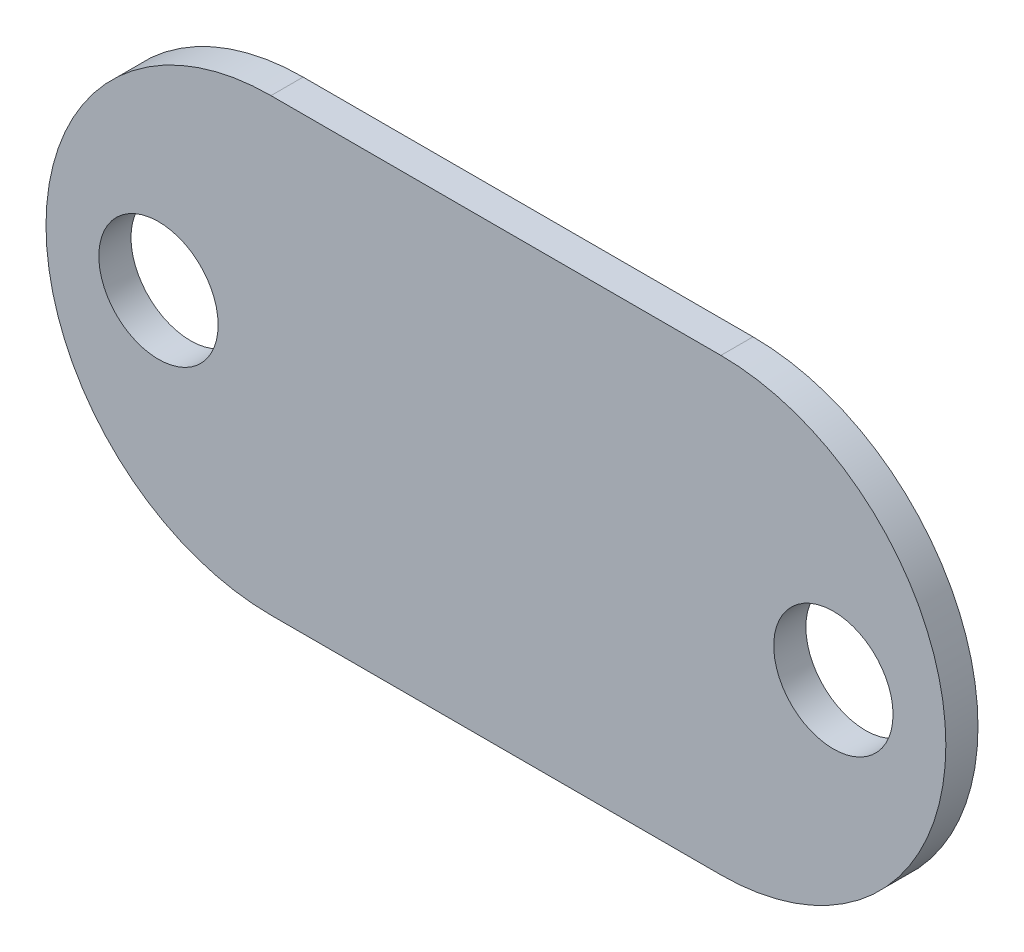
ISO-10303-21;
HEADER;
FILE_DESCRIPTION(('STEP AP214'),'2;1');
FILE_NAME('part.step','',(''),(''),'','','');
FILE_SCHEMA(('AUTOMOTIVE_DESIGN { 1 0 10303 214 1 1 1 1 }'));
ENDSEC;
DATA;
#1=APPLICATION_CONTEXT('core data for automotive mechanical design processes');
#2=APPLICATION_PROTOCOL_DEFINITION('international standard','automotive_design',2000,#1);
#3=PRODUCT_CONTEXT('',#1,'mechanical');
#4=PRODUCT('Part','Part','',(#3));
#5=PRODUCT_RELATED_PRODUCT_CATEGORY('part','',(#4));
#6=PRODUCT_DEFINITION_FORMATION('','',#4);
#7=PRODUCT_DEFINITION_CONTEXT('part definition',#1,'design');
#8=PRODUCT_DEFINITION('design','',#6,#7);
#9=PRODUCT_DEFINITION_SHAPE('','',#8);
#10=(LENGTH_UNIT() NAMED_UNIT(*) SI_UNIT(.MILLI.,.METRE.));
#11=(NAMED_UNIT(*) PLANE_ANGLE_UNIT() SI_UNIT($,.RADIAN.));
#12=(NAMED_UNIT(*) SI_UNIT($,.STERADIAN.) SOLID_ANGLE_UNIT());
#13=UNCERTAINTY_MEASURE_WITH_UNIT(LENGTH_MEASURE(1.E-05),#10,'distance_accuracy_value','');
#14=(GEOMETRIC_REPRESENTATION_CONTEXT(3) GLOBAL_UNCERTAINTY_ASSIGNED_CONTEXT((#13)) GLOBAL_UNIT_ASSIGNED_CONTEXT((#10,
#11,#12)) REPRESENTATION_CONTEXT('',''));
#15=CARTESIAN_POINT('',(0.,0.,0.));
#16=DIRECTION('',(0.,0.,1.));
#17=DIRECTION('',(1.,0.,0.));
#18=AXIS2_PLACEMENT_3D('',#15,#16,#17);
#19=CARTESIAN_POINT('',(-5.55625,0.,0.79375));
#20=DIRECTION('',(0.,0.,-1.));
#21=DIRECTION('',(-1.,0.,0.));
#22=AXIS2_PLACEMENT_3D('',#19,#20,#21);
#23=CYLINDRICAL_SURFACE('',#22,5.55625);
#24=CARTESIAN_POINT('',(-5.55625,0.,0.));
#25=DIRECTION('',(0.,0.,1.));
#26=DIRECTION('',(-1.,0.,0.));
#27=AXIS2_PLACEMENT_3D('',#24,#25,#26);
#28=CIRCLE('',#27,5.55625);
#29=CARTESIAN_POINT('',(-5.55625,5.55625,0.));
#30=VERTEX_POINT('',#29);
#31=CARTESIAN_POINT('',(-5.55625,-5.55625,0.));
#32=VERTEX_POINT('',#31);
#33=EDGE_CURVE('E79',#30,#32,#28,.T.);
#34=ORIENTED_EDGE('',*,*,#33,.T.);
#35=DIRECTION('',(0.,0.,-1.));
#36=VECTOR('',#35,1.);
#37=CARTESIAN_POINT('',(-5.55625,-5.55625,0.79375));
#38=LINE('',#37,#36);
#39=CARTESIAN_POINT('',(-5.55625,-5.55625,0.79375));
#40=VERTEX_POINT('',#39);
#41=EDGE_CURVE('E11',#40,#32,#38,.T.);
#42=ORIENTED_EDGE('',*,*,#41,.F.);
#43=CARTESIAN_POINT('',(-5.55625,0.,0.79375));
#44=DIRECTION('',(0.,0.,1.));
#45=DIRECTION('',(-1.,0.,0.));
#46=AXIS2_PLACEMENT_3D('',#43,#44,#45);
#47=CIRCLE('',#46,5.55625);
#48=CARTESIAN_POINT('',(-5.55625,5.55625,0.79375));
#49=VERTEX_POINT('',#48);
#50=EDGE_CURVE('E102',#49,#40,#47,.T.);
#51=ORIENTED_EDGE('',*,*,#50,.F.);
#52=DIRECTION('',(0.,0.,-1.));
#53=VECTOR('',#52,1.);
#54=CARTESIAN_POINT('',(-5.55625,5.55625,0.79375));
#55=LINE('',#54,#53);
#56=EDGE_CURVE('E91',#49,#30,#55,.T.);
#57=ORIENTED_EDGE('',*,*,#56,.T.);
#58=EDGE_LOOP('',(#34,#42,#51,#57));
#59=FACE_BOUND('',#58,.T.);
#60=ADVANCED_FACE('F33',(#59),#23,.T.);
#61=CARTESIAN_POINT('',(-5.55625,-5.55625,0.79375));
#62=DIRECTION('',(0.,1.,0.));
#63=DIRECTION('',(0.,0.,1.));
#64=AXIS2_PLACEMENT_3D('',#61,#62,#63);
#65=PLANE('',#64);
#66=DIRECTION('',(1.,0.,0.));
#67=VECTOR('',#66,1.);
#68=CARTESIAN_POINT('',(-5.55625,-5.55625,0.));
#69=LINE('',#68,#67);
#70=CARTESIAN_POINT('',(5.55625,-5.55625,0.));
#71=VERTEX_POINT('',#70);
#72=EDGE_CURVE('E75',#32,#71,#69,.T.);
#73=ORIENTED_EDGE('',*,*,#72,.T.);
#74=DIRECTION('',(0.,0.,-1.));
#75=VECTOR('',#74,1.);
#76=CARTESIAN_POINT('',(5.55625,-5.55625,0.79375));
#77=LINE('',#76,#75);
#78=CARTESIAN_POINT('',(5.55625,-5.55625,0.79375));
#79=VERTEX_POINT('',#78);
#80=EDGE_CURVE('E41',#79,#71,#77,.T.);
#81=ORIENTED_EDGE('',*,*,#80,.F.);
#82=DIRECTION('',(1.,0.,0.));
#83=VECTOR('',#82,1.);
#84=CARTESIAN_POINT('',(-5.55625,-5.55625,0.79375));
#85=LINE('',#84,#83);
#86=EDGE_CURVE('E87',#40,#79,#85,.T.);
#87=ORIENTED_EDGE('',*,*,#86,.F.);
#88=ORIENTED_EDGE('',*,*,#41,.T.);
#89=EDGE_LOOP('',(#73,#81,#87,#88));
#90=FACE_BOUND('',#89,.T.);
#91=ADVANCED_FACE('F86',(#90),#65,.F.);
#92=CARTESIAN_POINT('',(5.55625,0.,0.79375));
#93=DIRECTION('',(0.,0.,-1.));
#94=DIRECTION('',(-1.,0.,0.));
#95=AXIS2_PLACEMENT_3D('',#92,#93,#94);
#96=CYLINDRICAL_SURFACE('',#95,5.55625);
#97=CARTESIAN_POINT('',(5.55625,0.,0.));
#98=DIRECTION('',(0.,0.,1.));
#99=DIRECTION('',(1.,0.,0.));
#100=AXIS2_PLACEMENT_3D('',#97,#98,#99);
#101=CIRCLE('',#100,5.55625);
#102=CARTESIAN_POINT('',(5.55625,5.55625,0.));
#103=VERTEX_POINT('',#102);
#104=EDGE_CURVE('E80',#71,#103,#101,.T.);
#105=ORIENTED_EDGE('',*,*,#104,.T.);
#106=DIRECTION('',(0.,0.,-1.));
#107=VECTOR('',#106,1.);
#108=CARTESIAN_POINT('',(5.55625,5.55625,0.79375));
#109=LINE('',#108,#107);
#110=CARTESIAN_POINT('',(5.55625,5.55625,0.79375));
#111=VERTEX_POINT('',#110);
#112=EDGE_CURVE('E108',#111,#103,#109,.T.);
#113=ORIENTED_EDGE('',*,*,#112,.F.);
#114=CARTESIAN_POINT('',(5.55625,0.,0.79375));
#115=DIRECTION('',(0.,0.,1.));
#116=DIRECTION('',(1.,0.,0.));
#117=AXIS2_PLACEMENT_3D('',#114,#115,#116);
#118=CIRCLE('',#117,5.55625);
#119=EDGE_CURVE('E54',#79,#111,#118,.T.);
#120=ORIENTED_EDGE('',*,*,#119,.F.);
#121=ORIENTED_EDGE('',*,*,#80,.T.);
#122=EDGE_LOOP('',(#105,#113,#120,#121));
#123=FACE_BOUND('',#122,.T.);
#124=ADVANCED_FACE('F112',(#123),#96,.T.);
#125=CARTESIAN_POINT('',(-5.55625,5.55625,0.79375));
#126=DIRECTION('',(0.,-1.,0.));
#127=DIRECTION('',(0.,0.,-1.));
#128=AXIS2_PLACEMENT_3D('',#125,#126,#127);
#129=PLANE('',#128);
#130=DIRECTION('',(-1.,0.,0.));
#131=VECTOR('',#130,1.);
#132=CARTESIAN_POINT('',(-5.55625,5.55625,0.));
#133=LINE('',#132,#131);
#134=EDGE_CURVE('E100',#103,#30,#133,.T.);
#135=ORIENTED_EDGE('',*,*,#134,.T.);
#136=ORIENTED_EDGE('',*,*,#56,.F.);
#137=DIRECTION('',(-1.,0.,0.));
#138=VECTOR('',#137,1.);
#139=CARTESIAN_POINT('',(-5.55625,5.55625,0.79375));
#140=LINE('',#139,#138);
#141=EDGE_CURVE('E49',#111,#49,#140,.T.);
#142=ORIENTED_EDGE('',*,*,#141,.F.);
#143=ORIENTED_EDGE('',*,*,#112,.T.);
#144=EDGE_LOOP('',(#135,#136,#142,#143));
#145=FACE_BOUND('',#144,.T.);
#146=ADVANCED_FACE('F114',(#145),#129,.F.);
#147=CARTESIAN_POINT('',(-5.55625,0.,0.79375));
#148=DIRECTION('',(0.,0.,-1.));
#149=DIRECTION('',(-1.,0.,0.));
#150=AXIS2_PLACEMENT_3D('',#147,#148,#149);
#151=PLANE('',#150);
#152=CARTESIAN_POINT('',(-8.334375,0.,0.793750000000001));
#153=DIRECTION('',(0.,0.,1.));
#154=DIRECTION('',(1.,0.,0.));
#155=AXIS2_PLACEMENT_3D('',#152,#153,#154);
#156=CIRCLE('',#155,1.4732);
#157=CARTESIAN_POINT('',(-6.861175,0.,0.793750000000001));
#158=VERTEX_POINT('',#157);
#159=EDGE_CURVE('E183',#158,#158,#156,.T.);
#160=ORIENTED_EDGE('',*,*,#159,.F.);
#161=EDGE_LOOP('',(#160));
#162=FACE_BOUND('',#161,.T.);
#163=CARTESIAN_POINT('',(8.334375,0.,0.793750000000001));
#164=DIRECTION('',(0.,0.,1.));
#165=DIRECTION('',(1.,0.,0.));
#166=AXIS2_PLACEMENT_3D('',#163,#164,#165);
#167=CIRCLE('',#166,1.4732);
#168=CARTESIAN_POINT('',(9.807575,0.,0.793750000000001));
#169=VERTEX_POINT('',#168);
#170=EDGE_CURVE('E95',#169,#169,#167,.T.);
#171=ORIENTED_EDGE('',*,*,#170,.F.);
#172=EDGE_LOOP('',(#171));
#173=FACE_BOUND('',#172,.T.);
#174=ORIENTED_EDGE('',*,*,#50,.T.);
#175=ORIENTED_EDGE('',*,*,#86,.T.);
#176=ORIENTED_EDGE('',*,*,#119,.T.);
#177=ORIENTED_EDGE('',*,*,#141,.T.);
#178=EDGE_LOOP('',(#174,#175,#176,#177));
#179=FACE_BOUND('',#178,.T.);
#180=ADVANCED_FACE('F115',(#162,#173,#179),#151,.F.);
#181=CARTESIAN_POINT('',(-5.55625,0.,0.));
#182=DIRECTION('',(0.,0.,-1.));
#183=DIRECTION('',(-1.,0.,0.));
#184=AXIS2_PLACEMENT_3D('',#181,#182,#183);
#185=PLANE('',#184);
#186=CARTESIAN_POINT('',(-8.334375,0.,0.));
#187=DIRECTION('',(0.,0.,-1.));
#188=DIRECTION('',(-1.,0.,0.));
#189=AXIS2_PLACEMENT_3D('',#186,#187,#188);
#190=CIRCLE('',#189,1.4732);
#191=CARTESIAN_POINT('',(-9.80757499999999,0.,0.));
#192=VERTEX_POINT('',#191);
#193=EDGE_CURVE('E36',#192,#192,#190,.T.);
#194=ORIENTED_EDGE('',*,*,#193,.F.);
#195=EDGE_LOOP('',(#194));
#196=FACE_BOUND('',#195,.T.);
#197=CARTESIAN_POINT('',(8.334375,0.,0.));
#198=DIRECTION('',(0.,0.,-1.));
#199=DIRECTION('',(-1.,0.,0.));
#200=AXIS2_PLACEMENT_3D('',#197,#198,#199);
#201=CIRCLE('',#200,1.4732);
#202=CARTESIAN_POINT('',(6.861175,0.,0.));
#203=VERTEX_POINT('',#202);
#204=EDGE_CURVE('E92',#203,#203,#201,.T.);
#205=ORIENTED_EDGE('',*,*,#204,.F.);
#206=EDGE_LOOP('',(#205));
#207=FACE_BOUND('',#206,.T.);
#208=ORIENTED_EDGE('',*,*,#33,.F.);
#209=ORIENTED_EDGE('',*,*,#134,.F.);
#210=ORIENTED_EDGE('',*,*,#104,.F.);
#211=ORIENTED_EDGE('',*,*,#72,.F.);
#212=EDGE_LOOP('',(#208,#209,#210,#211));
#213=FACE_BOUND('',#212,.T.);
#214=ADVANCED_FACE('F76',(#196,#207,#213),#185,.T.);
#215=CARTESIAN_POINT('',(8.334375,0.,0.79375));
#216=DIRECTION('',(0.,0.,1.));
#217=DIRECTION('',(1.,0.,0.));
#218=AXIS2_PLACEMENT_3D('',#215,#216,#217);
#219=CYLINDRICAL_SURFACE('',#218,1.4732);
#220=ORIENTED_EDGE('',*,*,#204,.T.);
#221=EDGE_LOOP('',(#220));
#222=FACE_BOUND('',#221,.T.);
#223=ORIENTED_EDGE('',*,*,#170,.T.);
#224=EDGE_LOOP('',(#223));
#225=FACE_BOUND('',#224,.T.);
#226=ADVANCED_FACE('F123',(#222,#225),#219,.F.);
#227=CARTESIAN_POINT('',(-8.334375,0.,0.79375));
#228=DIRECTION('',(0.,0.,1.));
#229=DIRECTION('',(1.,0.,0.));
#230=AXIS2_PLACEMENT_3D('',#227,#228,#229);
#231=CYLINDRICAL_SURFACE('',#230,1.4732);
#232=ORIENTED_EDGE('',*,*,#193,.T.);
#233=EDGE_LOOP('',(#232));
#234=FACE_BOUND('',#233,.T.);
#235=ORIENTED_EDGE('',*,*,#159,.T.);
#236=EDGE_LOOP('',(#235));
#237=FACE_BOUND('',#236,.T.);
#238=ADVANCED_FACE('F165',(#234,#237),#231,.F.);
#239=CLOSED_SHELL('',(#60,#91,#124,#146,#180,#214,#226,#238));
#240=MANIFOLD_SOLID_BREP('B2',#239);
#241=ADVANCED_BREP_SHAPE_REPRESENTATION('',(#18,#240),#14);
#242=SHAPE_DEFINITION_REPRESENTATION(#9,#241);
ENDSEC;
END-ISO-10303-21;
